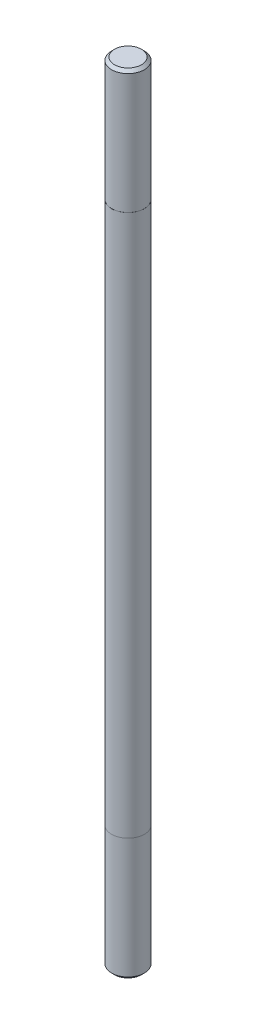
from build123d import *

# Parameters (mm, degrees)
SKETCH1_R      = 2
EXTRUDE1_DEPTH = 66
SKETCH2_R      = 1.99
EXTRUDE2_DEPTH = 15
EXTRUDE3_START = 15
SKETCH3_R      = 1.99
EXTRUDE3_DEPTH = 15
CHAMFER1_SIZE  = 0.35


with BuildPart() as part:
    # Sketch1 → Extrude1 (new body)
    with BuildSketch(Plane(origin=(0, 0, 0), x_dir=(1, 0, 0), z_dir=(0, 1, 0))):
        with Locations(Location((0, 0, 0), (0, 0, 270))):
            Circle(SKETCH1_R)
    extrude(amount=EXTRUDE1_DEPTH)

    # Sketch2 → Extrude2 (add)
    with BuildSketch(Plane(origin=(0, 66, 0), x_dir=(-1, 0, 0), z_dir=(0, 1, 0))):
        with Locations(Location((0, 0, 0), (0, 0, 90))):
            Circle(SKETCH2_R)
    extrude(amount=EXTRUDE2_DEPTH)

    # Sketch3 → Extrude3 (add)
    with BuildSketch(Plane.XZ.offset(EXTRUDE3_START)):
        with Locations(Location((0, 0, 0), (0, 0, 90))):
            Circle(SKETCH3_R)
    extrude(amount=-EXTRUDE3_DEPTH)

    # Chamfer1
    chamfer1_edges = [part.edges().sort_by_distance(p)[0] for p in [
        (0, -15, -1.99),
        (0, 81, -1.99),
    ]]
    chamfer(chamfer1_edges, length=CHAMFER1_SIZE)


solid = part.part
